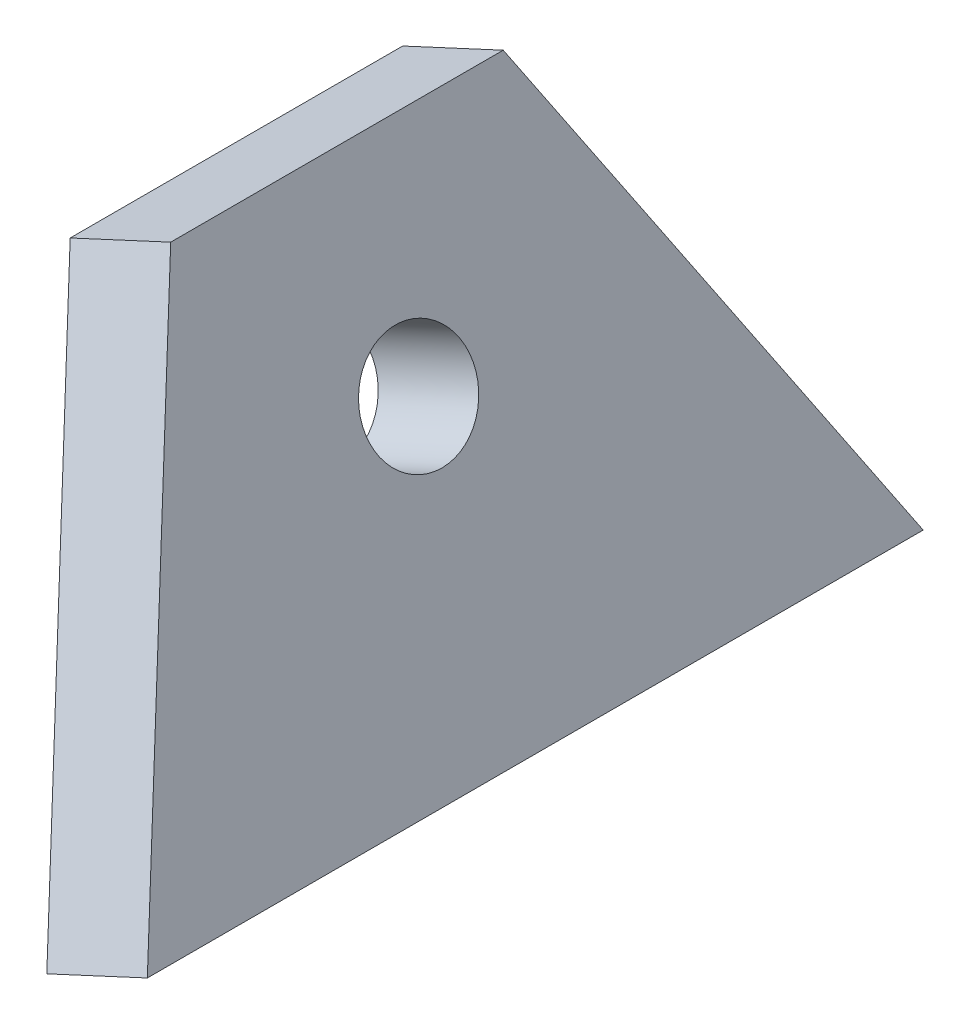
ISO-10303-21;
HEADER;
FILE_DESCRIPTION(('STEP AP214'),'2;1');
FILE_NAME('part.step','',(''),(''),'','','');
FILE_SCHEMA(('AUTOMOTIVE_DESIGN { 1 0 10303 214 1 1 1 1 }'));
ENDSEC;
DATA;
#1=APPLICATION_CONTEXT('core data for automotive mechanical design processes');
#2=APPLICATION_PROTOCOL_DEFINITION('international standard','automotive_design',2000,#1);
#3=PRODUCT_CONTEXT('',#1,'mechanical');
#4=PRODUCT('Part','Part','',(#3));
#5=PRODUCT_RELATED_PRODUCT_CATEGORY('part','',(#4));
#6=PRODUCT_DEFINITION_FORMATION('','',#4);
#7=PRODUCT_DEFINITION_CONTEXT('part definition',#1,'design');
#8=PRODUCT_DEFINITION('design','',#6,#7);
#9=PRODUCT_DEFINITION_SHAPE('','',#8);
#10=(LENGTH_UNIT() NAMED_UNIT(*) SI_UNIT(.MILLI.,.METRE.));
#11=(NAMED_UNIT(*) PLANE_ANGLE_UNIT() SI_UNIT($,.RADIAN.));
#12=(NAMED_UNIT(*) SI_UNIT($,.STERADIAN.) SOLID_ANGLE_UNIT());
#13=UNCERTAINTY_MEASURE_WITH_UNIT(LENGTH_MEASURE(1.E-05),#10,'distance_accuracy_value','');
#14=(GEOMETRIC_REPRESENTATION_CONTEXT(3) GLOBAL_UNCERTAINTY_ASSIGNED_CONTEXT((#13)) GLOBAL_UNIT_ASSIGNED_CONTEXT((#10,
#11,#12)) REPRESENTATION_CONTEXT('',''));
#15=CARTESIAN_POINT('',(0.,0.,0.));
#16=DIRECTION('',(0.,0.,1.));
#17=DIRECTION('',(1.,0.,0.));
#18=AXIS2_PLACEMENT_3D('',#15,#16,#17);
#19=CARTESIAN_POINT('',(419.95495355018,466.745434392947,-6.));
#20=DIRECTION('',(-0.179247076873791,0.386229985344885,-0.904818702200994));
#21=DIRECTION('',(0.,0.91971431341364,0.392588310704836));
#22=AXIS2_PLACEMENT_3D('',#19,#20,#21);
#23=PLANE('',#22);
#24=DIRECTION('',(0.380900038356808,-0.82073871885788,-0.425797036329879));
#25=VECTOR('',#24,1.);
#26=CARTESIAN_POINT('',(416.326652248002,465.061560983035,-6.));
#27=LINE('',#26,#25);
#28=CARTESIAN_POINT('',(416.326652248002,465.061560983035,-6.));
#29=VERTEX_POINT('',#28);
#30=CARTESIAN_POINT('',(423.483114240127,449.641280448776,-14.));
#31=VERTEX_POINT('',#30);
#32=EDGE_CURVE('E107',#29,#31,#27,.T.);
#33=ORIENTED_EDGE('',*,*,#32,.F.);
#34=DIRECTION('',(-0.907075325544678,-0.420968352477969,0.));
#35=VECTOR('',#34,1.);
#36=CARTESIAN_POINT('',(419.95495355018,466.745434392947,-6.));
#37=LINE('',#36,#35);
#38=CARTESIAN_POINT('',(419.95495355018,466.745434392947,-6.));
#39=VERTEX_POINT('',#38);
#40=EDGE_CURVE('E12',#39,#29,#37,.T.);
#41=ORIENTED_EDGE('',*,*,#40,.F.);
#42=DIRECTION('',(0.380900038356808,-0.82073871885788,-0.425797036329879));
#43=VECTOR('',#42,1.);
#44=CARTESIAN_POINT('',(419.95495355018,466.745434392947,-6.));
#45=LINE('',#44,#43);
#46=CARTESIAN_POINT('',(427.111415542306,451.325153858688,-14.));
#47=VERTEX_POINT('',#46);
#48=EDGE_CURVE('E100',#39,#47,#45,.T.);
#49=ORIENTED_EDGE('',*,*,#48,.T.);
#50=DIRECTION('',(-0.907075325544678,-0.420968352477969,0.));
#51=VECTOR('',#50,1.);
#52=CARTESIAN_POINT('',(427.111415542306,451.325153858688,-14.));
#53=LINE('',#52,#51);
#54=EDGE_CURVE('E83',#47,#31,#53,.T.);
#55=ORIENTED_EDGE('',*,*,#54,.T.);
#56=EDGE_LOOP('',(#33,#41,#49,#55));
#57=FACE_BOUND('',#56,.T.);
#58=ADVANCED_FACE('F40',(#57),#23,.T.);
#59=CARTESIAN_POINT('',(419.95495355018,466.745434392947,6.));
#60=DIRECTION('',(-0.420968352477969,0.907075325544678,0.));
#61=DIRECTION('',(-0.907075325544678,-0.420968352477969,0.));
#62=AXIS2_PLACEMENT_3D('',#59,#60,#61);
#63=PLANE('',#62);
#64=DIRECTION('',(0.,0.,-1.));
#65=VECTOR('',#64,1.);
#66=CARTESIAN_POINT('',(416.326652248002,465.061560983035,6.));
#67=LINE('',#66,#65);
#68=CARTESIAN_POINT('',(416.326652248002,465.061560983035,6.));
#69=VERTEX_POINT('',#68);
#70=EDGE_CURVE('E102',#69,#29,#67,.T.);
#71=ORIENTED_EDGE('',*,*,#70,.F.);
#72=DIRECTION('',(-0.907075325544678,-0.420968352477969,0.));
#73=VECTOR('',#72,1.);
#74=CARTESIAN_POINT('',(419.95495355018,466.745434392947,6.));
#75=LINE('',#74,#73);
#76=CARTESIAN_POINT('',(419.95495355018,466.745434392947,6.));
#77=VERTEX_POINT('',#76);
#78=EDGE_CURVE('E49',#77,#69,#75,.T.);
#79=ORIENTED_EDGE('',*,*,#78,.F.);
#80=DIRECTION('',(0.,0.,-1.));
#81=VECTOR('',#80,1.);
#82=CARTESIAN_POINT('',(419.95495355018,466.745434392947,6.));
#83=LINE('',#82,#81);
#84=EDGE_CURVE('E97',#77,#39,#83,.T.);
#85=ORIENTED_EDGE('',*,*,#84,.T.);
#86=ORIENTED_EDGE('',*,*,#40,.T.);
#87=EDGE_LOOP('',(#71,#79,#85,#86));
#88=FACE_BOUND('',#87,.T.);
#89=ADVANCED_FACE('F118',(#88),#63,.T.);
#90=CARTESIAN_POINT('',(427.111415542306,451.325153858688,14.));
#91=DIRECTION('',(-0.179247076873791,0.386229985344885,0.904818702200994));
#92=DIRECTION('',(0.,-0.91971431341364,0.392588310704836));
#93=AXIS2_PLACEMENT_3D('',#90,#91,#92);
#94=PLANE('',#93);
#95=DIRECTION('',(-0.380900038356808,0.82073871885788,-0.425797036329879));
#96=VECTOR('',#95,1.);
#97=CARTESIAN_POINT('',(423.483114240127,449.641280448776,14.));
#98=LINE('',#97,#96);
#99=CARTESIAN_POINT('',(423.483114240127,449.641280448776,14.));
#100=VERTEX_POINT('',#99);
#101=EDGE_CURVE('E91',#100,#69,#98,.T.);
#102=ORIENTED_EDGE('',*,*,#101,.F.);
#103=DIRECTION('',(-0.907075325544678,-0.420968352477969,0.));
#104=VECTOR('',#103,1.);
#105=CARTESIAN_POINT('',(427.111415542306,451.325153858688,14.));
#106=LINE('',#105,#104);
#107=CARTESIAN_POINT('',(427.111415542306,451.325153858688,14.));
#108=VERTEX_POINT('',#107);
#109=EDGE_CURVE('E86',#108,#100,#106,.T.);
#110=ORIENTED_EDGE('',*,*,#109,.F.);
#111=DIRECTION('',(-0.380900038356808,0.82073871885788,-0.425797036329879));
#112=VECTOR('',#111,1.);
#113=CARTESIAN_POINT('',(427.111415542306,451.325153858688,14.));
#114=LINE('',#113,#112);
#115=EDGE_CURVE('E89',#108,#77,#114,.T.);
#116=ORIENTED_EDGE('',*,*,#115,.T.);
#117=ORIENTED_EDGE('',*,*,#78,.T.);
#118=EDGE_LOOP('',(#102,#110,#116,#117));
#119=FACE_BOUND('',#118,.T.);
#120=ADVANCED_FACE('F88',(#119),#94,.T.);
#121=CARTESIAN_POINT('',(427.111415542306,451.325153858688,-14.));
#122=DIRECTION('',(0.420968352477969,-0.907075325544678,0.));
#123=DIRECTION('',(0.907075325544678,0.420968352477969,0.));
#124=AXIS2_PLACEMENT_3D('',#121,#122,#123);
#125=PLANE('',#124);
#126=DIRECTION('',(0.,0.,1.));
#127=VECTOR('',#126,1.);
#128=CARTESIAN_POINT('',(423.483114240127,449.641280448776,-14.));
#129=LINE('',#128,#127);
#130=EDGE_CURVE('E110',#31,#100,#129,.T.);
#131=ORIENTED_EDGE('',*,*,#130,.F.);
#132=ORIENTED_EDGE('',*,*,#54,.F.);
#133=DIRECTION('',(0.,0.,1.));
#134=VECTOR('',#133,1.);
#135=CARTESIAN_POINT('',(427.111415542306,451.325153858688,-14.));
#136=LINE('',#135,#134);
#137=EDGE_CURVE('E96',#47,#108,#136,.T.);
#138=ORIENTED_EDGE('',*,*,#137,.T.);
#139=ORIENTED_EDGE('',*,*,#109,.T.);
#140=EDGE_LOOP('',(#131,#132,#138,#139));
#141=FACE_BOUND('',#140,.T.);
#142=ADVANCED_FACE('F99',(#141),#125,.T.);
#143=CARTESIAN_POINT('',(523.759654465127,243.073791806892,0.));
#144=DIRECTION('',(-0.907075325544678,-0.42096835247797,0.));
#145=DIRECTION('',(0.42096835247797,-0.907075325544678,0.));
#146=AXIS2_PLACEMENT_3D('',#143,#144,#145);
#147=PLANE('',#146);
#148=CARTESIAN_POINT('',(422.901732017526,460.395907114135,0.));
#149=DIRECTION('',(-0.907075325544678,-0.42096835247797,0.));
#150=DIRECTION('',(0.42096835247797,-0.907075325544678,0.));
#151=AXIS2_PLACEMENT_3D('',#148,#149,#150);
#152=CIRCLE('',#151,2.);
#153=CARTESIAN_POINT('',(423.743668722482,458.581756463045,0.));
#154=VERTEX_POINT('',#153);
#155=EDGE_CURVE('E111',#154,#154,#152,.T.);
#156=ORIENTED_EDGE('',*,*,#155,.T.);
#157=EDGE_LOOP('',(#156));
#158=FACE_BOUND('',#157,.T.);
#159=ORIENTED_EDGE('',*,*,#48,.F.);
#160=ORIENTED_EDGE('',*,*,#84,.F.);
#161=ORIENTED_EDGE('',*,*,#115,.F.);
#162=ORIENTED_EDGE('',*,*,#137,.F.);
#163=EDGE_LOOP('',(#159,#160,#161,#162));
#164=FACE_BOUND('',#163,.T.);
#165=ADVANCED_FACE('F95',(#158,#164),#147,.F.);
#166=CARTESIAN_POINT('',(520.131353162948,241.38991839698,0.));
#167=DIRECTION('',(-0.907075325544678,-0.42096835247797,0.));
#168=DIRECTION('',(0.42096835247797,-0.907075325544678,0.));
#169=AXIS2_PLACEMENT_3D('',#166,#167,#168);
#170=PLANE('',#169);
#171=CARTESIAN_POINT('',(419.273430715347,458.712033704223,0.));
#172=DIRECTION('',(-0.907075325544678,-0.42096835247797,0.));
#173=DIRECTION('',(0.42096835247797,-0.907075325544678,0.));
#174=AXIS2_PLACEMENT_3D('',#171,#172,#173);
#175=CIRCLE('',#174,2.);
#176=CARTESIAN_POINT('',(420.115367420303,456.897883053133,0.));
#177=VERTEX_POINT('',#176);
#178=EDGE_CURVE('E43',#177,#177,#175,.T.);
#179=ORIENTED_EDGE('',*,*,#178,.F.);
#180=EDGE_LOOP('',(#179));
#181=FACE_BOUND('',#180,.T.);
#182=ORIENTED_EDGE('',*,*,#32,.T.);
#183=ORIENTED_EDGE('',*,*,#130,.T.);
#184=ORIENTED_EDGE('',*,*,#101,.T.);
#185=ORIENTED_EDGE('',*,*,#70,.T.);
#186=EDGE_LOOP('',(#182,#183,#184,#185));
#187=FACE_BOUND('',#186,.T.);
#188=ADVANCED_FACE('F117',(#181,#187),#170,.T.);
#189=CARTESIAN_POINT('',(418.366355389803,458.291065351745,0.));
#190=DIRECTION('',(0.90707532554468,0.420968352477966,0.));
#191=DIRECTION('',(-0.420968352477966,0.90707532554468,0.));
#192=AXIS2_PLACEMENT_3D('',#189,#190,#191);
#193=CYLINDRICAL_SURFACE('',#192,2.);
#194=ORIENTED_EDGE('',*,*,#178,.T.);
#195=EDGE_LOOP('',(#194));
#196=FACE_BOUND('',#195,.T.);
#197=ORIENTED_EDGE('',*,*,#155,.F.);
#198=EDGE_LOOP('',(#197));
#199=FACE_BOUND('',#198,.T.);
#200=ADVANCED_FACE('F136',(#196,#199),#193,.F.);
#201=CLOSED_SHELL('',(#58,#89,#120,#142,#165,#188,#200));
#202=MANIFOLD_SOLID_BREP('B2',#201);
#203=ADVANCED_BREP_SHAPE_REPRESENTATION('',(#18,#202),#14);
#204=SHAPE_DEFINITION_REPRESENTATION(#9,#203);
ENDSEC;
END-ISO-10303-21;
